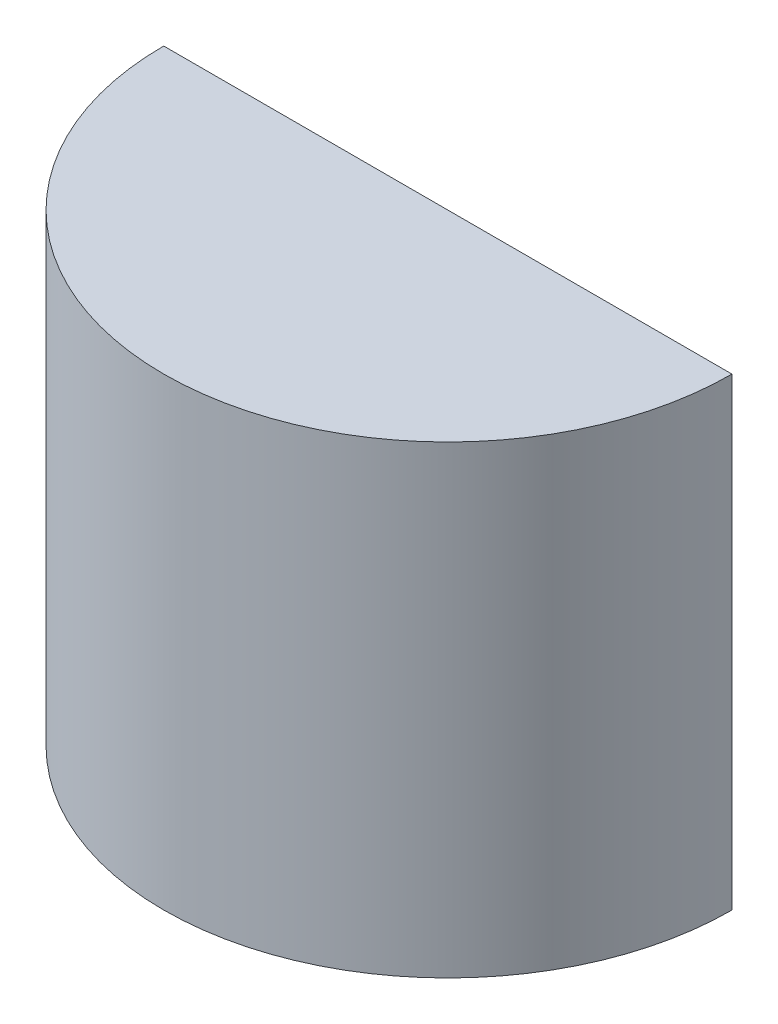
ISO-10303-21;
HEADER;
FILE_DESCRIPTION(('STEP AP214'),'2;1');
FILE_NAME('part.step','',(''),(''),'','','');
FILE_SCHEMA(('AUTOMOTIVE_DESIGN { 1 0 10303 214 1 1 1 1 }'));
ENDSEC;
DATA;
#1=APPLICATION_CONTEXT('core data for automotive mechanical design processes');
#2=APPLICATION_PROTOCOL_DEFINITION('international standard','automotive_design',2000,#1);
#3=PRODUCT_CONTEXT('',#1,'mechanical');
#4=PRODUCT('Part','Part','',(#3));
#5=PRODUCT_RELATED_PRODUCT_CATEGORY('part','',(#4));
#6=PRODUCT_DEFINITION_FORMATION('','',#4);
#7=PRODUCT_DEFINITION_CONTEXT('part definition',#1,'design');
#8=PRODUCT_DEFINITION('design','',#6,#7);
#9=PRODUCT_DEFINITION_SHAPE('','',#8);
#10=(LENGTH_UNIT() NAMED_UNIT(*) SI_UNIT(.MILLI.,.METRE.));
#11=(NAMED_UNIT(*) PLANE_ANGLE_UNIT() SI_UNIT($,.RADIAN.));
#12=(NAMED_UNIT(*) SI_UNIT($,.STERADIAN.) SOLID_ANGLE_UNIT());
#13=UNCERTAINTY_MEASURE_WITH_UNIT(LENGTH_MEASURE(1.E-05),#10,'distance_accuracy_value','');
#14=(GEOMETRIC_REPRESENTATION_CONTEXT(3) GLOBAL_UNCERTAINTY_ASSIGNED_CONTEXT((#13)) GLOBAL_UNIT_ASSIGNED_CONTEXT((#10,
#11,#12)) REPRESENTATION_CONTEXT('',''));
#15=CARTESIAN_POINT('',(0.,0.,0.));
#16=DIRECTION('',(0.,0.,1.));
#17=DIRECTION('',(1.,0.,0.));
#18=AXIS2_PLACEMENT_3D('',#15,#16,#17);
#19=CARTESIAN_POINT('',(0.,-17.5013815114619,50.5));
#20=DIRECTION('',(0.,1.,0.));
#21=DIRECTION('',(0.,0.,1.));
#22=AXIS2_PLACEMENT_3D('',#19,#20,#21);
#23=PLANE('',#22);
#24=CARTESIAN_POINT('',(0.,-17.5013815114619,0.));
#25=DIRECTION('',(0.,-1.,0.));
#26=DIRECTION('',(0.,0.,-1.));
#27=AXIS2_PLACEMENT_3D('',#24,#25,#26);
#28=CIRCLE('',#27,50.5);
#29=CARTESIAN_POINT('',(50.5,-17.5013815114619,0.));
#30=VERTEX_POINT('',#29);
#31=CARTESIAN_POINT('',(-50.5,-17.5013815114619,0.));
#32=VERTEX_POINT('',#31);
#33=EDGE_CURVE('E84',#30,#32,#28,.T.);
#34=ORIENTED_EDGE('',*,*,#33,.T.);
#35=DIRECTION('',(1.,0.,0.));
#36=VECTOR('',#35,1.);
#37=CARTESIAN_POINT('',(0.,-17.5013815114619,0.));
#38=LINE('',#37,#36);
#39=CARTESIAN_POINT('',(-46.5209139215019,-17.5013815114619,0.));
#40=VERTEX_POINT('',#39);
#41=EDGE_CURVE('E88',#32,#40,#38,.T.);
#42=ORIENTED_EDGE('',*,*,#41,.T.);
#43=CARTESIAN_POINT('',(0.,-17.5013815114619,0.));
#44=DIRECTION('',(0.,-1.,0.));
#45=DIRECTION('',(0.,0.,-1.));
#46=AXIS2_PLACEMENT_3D('',#43,#44,#45);
#47=CIRCLE('',#46,46.5209139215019);
#48=CARTESIAN_POINT('',(46.5209139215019,-17.5013815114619,0.));
#49=VERTEX_POINT('',#48);
#50=EDGE_CURVE('E79',#49,#40,#47,.T.);
#51=ORIENTED_EDGE('',*,*,#50,.F.);
#52=EDGE_CURVE('E73',#49,#30,#38,.T.);
#53=ORIENTED_EDGE('',*,*,#52,.T.);
#54=EDGE_LOOP('',(#34,#42,#51,#53));
#55=FACE_BOUND('',#54,.T.);
#56=ADVANCED_FACE('F35',(#55),#23,.F.);
#57=CARTESIAN_POINT('',(0.,0.,0.));
#58=DIRECTION('',(0.,-1.,0.));
#59=DIRECTION('',(0.,0.,-1.));
#60=AXIS2_PLACEMENT_3D('',#57,#58,#59);
#61=CONICAL_SURFACE('',#60,45.5,0.0582673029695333);
#62=ORIENTED_EDGE('',*,*,#50,.T.);
#63=DIRECTION('',(-0.0582343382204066,-0.998302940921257,0.));
#64=VECTOR('',#63,1.);
#65=CARTESIAN_POINT('',(0.,780.000000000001,0.));
#66=LINE('',#65,#64);
#67=CARTESIAN_POINT('',(-42.,60.,0.));
#68=VERTEX_POINT('',#67);
#69=EDGE_CURVE('E91',#40,#68,#66,.F.);
#70=ORIENTED_EDGE('',*,*,#69,.T.);
#71=CARTESIAN_POINT('',(0.,60.,0.));
#72=DIRECTION('',(0.,-1.,0.));
#73=DIRECTION('',(0.,0.,-1.));
#74=AXIS2_PLACEMENT_3D('',#71,#72,#73);
#75=CIRCLE('',#74,42.);
#76=CARTESIAN_POINT('',(42.,60.0000000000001,0.));
#77=VERTEX_POINT('',#76);
#78=EDGE_CURVE('E93',#77,#68,#75,.T.);
#79=ORIENTED_EDGE('',*,*,#78,.F.);
#80=DIRECTION('',(-0.0582343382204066,0.998302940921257,0.));
#81=VECTOR('',#80,1.);
#82=CARTESIAN_POINT('',(0.,780.000000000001,0.));
#83=LINE('',#82,#81);
#84=EDGE_CURVE('E86',#77,#49,#83,.F.);
#85=ORIENTED_EDGE('',*,*,#84,.T.);
#86=EDGE_LOOP('',(#62,#70,#79,#85));
#87=FACE_BOUND('',#86,.T.);
#88=ADVANCED_FACE('F101',(#87),#61,.F.);
#89=CARTESIAN_POINT('',(0.,60.,42.));
#90=DIRECTION('',(0.,1.,0.));
#91=DIRECTION('',(0.,0.,1.));
#92=AXIS2_PLACEMENT_3D('',#89,#90,#91);
#93=PLANE('',#92);
#94=ORIENTED_EDGE('',*,*,#78,.T.);
#95=DIRECTION('',(1.,0.,0.));
#96=VECTOR('',#95,1.);
#97=CARTESIAN_POINT('',(0.,60.,0.));
#98=LINE('',#97,#96);
#99=EDGE_CURVE('E56',#68,#77,#98,.T.);
#100=ORIENTED_EDGE('',*,*,#99,.T.);
#101=EDGE_LOOP('',(#94,#100));
#102=FACE_BOUND('',#101,.T.);
#103=ADVANCED_FACE('F106',(#102),#93,.F.);
#104=CARTESIAN_POINT('',(0.,65.,45.5));
#105=DIRECTION('',(0.,-1.,0.));
#106=DIRECTION('',(0.,0.,-1.));
#107=AXIS2_PLACEMENT_3D('',#104,#105,#106);
#108=PLANE('',#107);
#109=CARTESIAN_POINT('',(0.,65.,0.));
#110=DIRECTION('',(0.,-1.,0.));
#111=DIRECTION('',(0.,0.,-1.));
#112=AXIS2_PLACEMENT_3D('',#109,#110,#111);
#113=CIRCLE('',#112,50.5);
#114=CARTESIAN_POINT('',(50.5,65.,0.));
#115=VERTEX_POINT('',#114);
#116=CARTESIAN_POINT('',(-50.5,65.,0.));
#117=VERTEX_POINT('',#116);
#118=EDGE_CURVE('E90',#115,#117,#113,.T.);
#119=ORIENTED_EDGE('',*,*,#118,.F.);
#120=DIRECTION('',(-1.,0.,0.));
#121=VECTOR('',#120,1.);
#122=CARTESIAN_POINT('',(0.,65.,0.));
#123=LINE('',#122,#121);
#124=EDGE_CURVE('E49',#115,#117,#123,.T.);
#125=ORIENTED_EDGE('',*,*,#124,.T.);
#126=EDGE_LOOP('',(#119,#125));
#127=FACE_BOUND('',#126,.T.);
#128=ADVANCED_FACE('F108',(#127),#108,.F.);
#129=CARTESIAN_POINT('',(0.,0.,0.));
#130=DIRECTION('',(0.,-1.,0.));
#131=DIRECTION('',(0.,0.,-1.));
#132=AXIS2_PLACEMENT_3D('',#129,#130,#131);
#133=CYLINDRICAL_SURFACE('',#132,50.5);
#134=ORIENTED_EDGE('',*,*,#118,.T.);
#135=DIRECTION('',(0.,-1.,0.));
#136=VECTOR('',#135,1.);
#137=CARTESIAN_POINT('',(-50.5,0.,0.));
#138=LINE('',#137,#136);
#139=EDGE_CURVE('E11',#117,#32,#138,.T.);
#140=ORIENTED_EDGE('',*,*,#139,.T.);
#141=ORIENTED_EDGE('',*,*,#33,.F.);
#142=DIRECTION('',(0.,-1.,0.));
#143=VECTOR('',#142,1.);
#144=CARTESIAN_POINT('',(50.5,0.,0.));
#145=LINE('',#144,#143);
#146=EDGE_CURVE('E42',#30,#115,#145,.F.);
#147=ORIENTED_EDGE('',*,*,#146,.T.);
#148=EDGE_LOOP('',(#134,#140,#141,#147));
#149=FACE_BOUND('',#148,.T.);
#150=ADVANCED_FACE('F89',(#149),#133,.T.);
#151=CARTESIAN_POINT('',(0.,0.,0.));
#152=DIRECTION('',(0.,0.,1.));
#153=DIRECTION('',(1.,0.,0.));
#154=AXIS2_PLACEMENT_3D('',#151,#152,#153);
#155=PLANE('',#154);
#156=ORIENTED_EDGE('',*,*,#41,.F.);
#157=ORIENTED_EDGE('',*,*,#139,.F.);
#158=ORIENTED_EDGE('',*,*,#124,.F.);
#159=ORIENTED_EDGE('',*,*,#146,.F.);
#160=ORIENTED_EDGE('',*,*,#52,.F.);
#161=ORIENTED_EDGE('',*,*,#84,.F.);
#162=ORIENTED_EDGE('',*,*,#99,.F.);
#163=ORIENTED_EDGE('',*,*,#69,.F.);
#164=EDGE_LOOP('',(#156,#157,#158,#159,#160,#161,#162,#163));
#165=FACE_BOUND('',#164,.T.);
#166=ADVANCED_FACE('F72',(#165),#155,.F.);
#167=CLOSED_SHELL('',(#56,#88,#103,#128,#150,#166));
#168=MANIFOLD_SOLID_BREP('B2',#167);
#169=ADVANCED_BREP_SHAPE_REPRESENTATION('',(#18,#168),#14);
#170=SHAPE_DEFINITION_REPRESENTATION(#9,#169);
ENDSEC;
END-ISO-10303-21;
